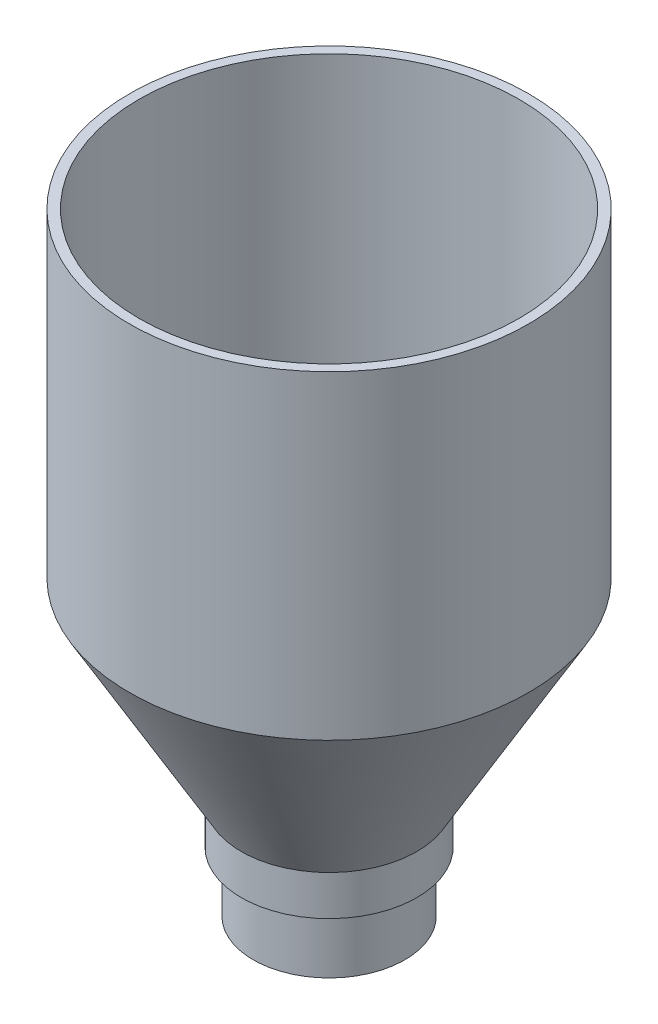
ISO-10303-21;
HEADER;
FILE_DESCRIPTION(('STEP AP214'),'2;1');
FILE_NAME('part.step','',(''),(''),'','','');
FILE_SCHEMA(('AUTOMOTIVE_DESIGN { 1 0 10303 214 1 1 1 1 }'));
ENDSEC;
DATA;
#1=APPLICATION_CONTEXT('core data for automotive mechanical design processes');
#2=APPLICATION_PROTOCOL_DEFINITION('international standard','automotive_design',2000,#1);
#3=PRODUCT_CONTEXT('',#1,'mechanical');
#4=PRODUCT('Part','Part','',(#3));
#5=PRODUCT_RELATED_PRODUCT_CATEGORY('part','',(#4));
#6=PRODUCT_DEFINITION_FORMATION('','',#4);
#7=PRODUCT_DEFINITION_CONTEXT('part definition',#1,'design');
#8=PRODUCT_DEFINITION('design','',#6,#7);
#9=PRODUCT_DEFINITION_SHAPE('','',#8);
#10=(LENGTH_UNIT() NAMED_UNIT(*) SI_UNIT(.MILLI.,.METRE.));
#11=(NAMED_UNIT(*) PLANE_ANGLE_UNIT() SI_UNIT($,.RADIAN.));
#12=(NAMED_UNIT(*) SI_UNIT($,.STERADIAN.) SOLID_ANGLE_UNIT());
#13=UNCERTAINTY_MEASURE_WITH_UNIT(LENGTH_MEASURE(1.E-05),#10,'distance_accuracy_value','');
#14=(GEOMETRIC_REPRESENTATION_CONTEXT(3) GLOBAL_UNCERTAINTY_ASSIGNED_CONTEXT((#13)) GLOBAL_UNIT_ASSIGNED_CONTEXT((#10,
#11,#12)) REPRESENTATION_CONTEXT('',''));
#15=CARTESIAN_POINT('',(0.,0.,0.));
#16=DIRECTION('',(0.,0.,1.));
#17=DIRECTION('',(1.,0.,0.));
#18=AXIS2_PLACEMENT_3D('',#15,#16,#17);
#19=CARTESIAN_POINT('',(0.,-4.53601171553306,0.));
#20=DIRECTION('',(0.,-1.,0.));
#21=DIRECTION('',(0.,0.,-1.));
#22=AXIS2_PLACEMENT_3D('',#19,#20,#21);
#23=CYLINDRICAL_SURFACE('',#22,25.);
#24=CARTESIAN_POINT('',(0.,36.7487113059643,0.));
#25=DIRECTION('',(0.,-1.,0.));
#26=DIRECTION('',(0.,0.,-1.));
#27=AXIS2_PLACEMENT_3D('',#24,#25,#26);
#28=CIRCLE('',#27,25.);
#29=CARTESIAN_POINT('',(0.,36.7487113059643,-25.));
#30=VERTEX_POINT('',#29);
#31=EDGE_CURVE('E70',#30,#30,#28,.T.);
#32=ORIENTED_EDGE('',*,*,#31,.F.);
#33=EDGE_LOOP('',(#32));
#34=FACE_BOUND('',#33,.T.);
#35=CARTESIAN_POINT('',(0.,76.7487113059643,0.));
#36=DIRECTION('',(0.,-1.,0.));
#37=DIRECTION('',(0.,0.,-1.));
#38=AXIS2_PLACEMENT_3D('',#35,#36,#37);
#39=CIRCLE('',#38,25.);
#40=CARTESIAN_POINT('',(0.,76.7487113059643,-25.));
#41=VERTEX_POINT('',#40);
#42=EDGE_CURVE('E10',#41,#41,#39,.T.);
#43=ORIENTED_EDGE('',*,*,#42,.T.);
#44=EDGE_LOOP('',(#43));
#45=FACE_BOUND('',#44,.T.);
#46=ADVANCED_FACE('F33',(#34,#45),#23,.T.);
#47=CARTESIAN_POINT('',(-25.,76.7487113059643,0.));
#48=DIRECTION('',(0.,-1.,0.));
#49=DIRECTION('',(0.,0.,-1.));
#50=AXIS2_PLACEMENT_3D('',#47,#48,#49);
#51=PLANE('',#50);
#52=ORIENTED_EDGE('',*,*,#42,.F.);
#53=EDGE_LOOP('',(#52));
#54=FACE_BOUND('',#53,.T.);
#55=CARTESIAN_POINT('',(0.,76.7487113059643,0.));
#56=DIRECTION('',(0.,-1.,0.));
#57=DIRECTION('',(0.,0.,-1.));
#58=AXIS2_PLACEMENT_3D('',#55,#56,#57);
#59=CIRCLE('',#58,23.8);
#60=CARTESIAN_POINT('',(0.,76.7487113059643,-23.8));
#61=VERTEX_POINT('',#60);
#62=EDGE_CURVE('E39',#61,#61,#59,.T.);
#63=ORIENTED_EDGE('',*,*,#62,.T.);
#64=EDGE_LOOP('',(#63));
#65=FACE_BOUND('',#64,.T.);
#66=ADVANCED_FACE('F77',(#54,#65),#51,.F.);
#67=CARTESIAN_POINT('',(0.,-4.53601171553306,0.));
#68=DIRECTION('',(0.,-1.,0.));
#69=DIRECTION('',(0.,0.,-1.));
#70=AXIS2_PLACEMENT_3D('',#67,#68,#69);
#71=CYLINDRICAL_SURFACE('',#70,23.8);
#72=ORIENTED_EDGE('',*,*,#62,.F.);
#73=EDGE_LOOP('',(#72));
#74=FACE_BOUND('',#73,.T.);
#75=CARTESIAN_POINT('',(0.,37.0702503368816,0.));
#76=DIRECTION('',(0.,-1.,0.));
#77=DIRECTION('',(0.,0.,-1.));
#78=AXIS2_PLACEMENT_3D('',#75,#76,#77);
#79=CIRCLE('',#78,23.8);
#80=CARTESIAN_POINT('',(0.,37.0702503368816,-23.8));
#81=VERTEX_POINT('',#80);
#82=EDGE_CURVE('E43',#81,#81,#79,.T.);
#83=ORIENTED_EDGE('',*,*,#82,.T.);
#84=EDGE_LOOP('',(#83));
#85=FACE_BOUND('',#84,.T.);
#86=ADVANCED_FACE('F81',(#74,#85),#71,.F.);
#87=CARTESIAN_POINT('',(0.,11.6124355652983,0.));
#88=DIRECTION('',(0.,1.,0.));
#89=DIRECTION('',(0.,0.,1.));
#90=AXIS2_PLACEMENT_3D('',#87,#88,#89);
#91=CONICAL_SURFACE('',#90,9.10192378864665,0.523598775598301);
#92=ORIENTED_EDGE('',*,*,#82,.F.);
#93=EDGE_LOOP('',(#92));
#94=FACE_BOUND('',#93,.T.);
#95=CARTESIAN_POINT('',(0.,11.6124355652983,0.));
#96=DIRECTION('',(0.,-1.,0.));
#97=DIRECTION('',(0.,0.,-1.));
#98=AXIS2_PLACEMENT_3D('',#95,#96,#97);
#99=CIRCLE('',#98,9.10192378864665);
#100=CARTESIAN_POINT('',(0.,11.6124355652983,-9.10192378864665));
#101=VERTEX_POINT('',#100);
#102=EDGE_CURVE('E47',#101,#101,#99,.T.);
#103=ORIENTED_EDGE('',*,*,#102,.T.);
#104=EDGE_LOOP('',(#103));
#105=FACE_BOUND('',#104,.T.);
#106=ADVANCED_FACE('F86',(#94,#105),#91,.F.);
#107=CARTESIAN_POINT('',(0.,7.50000000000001,0.));
#108=DIRECTION('',(0.,-1.,0.));
#109=DIRECTION('',(0.,0.,-1.));
#110=AXIS2_PLACEMENT_3D('',#107,#108,#109);
#111=TOROIDAL_SURFACE('',#110,16.2248711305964,8.22487113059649);
#112=ORIENTED_EDGE('',*,*,#102,.F.);
#113=EDGE_LOOP('',(#112));
#114=FACE_BOUND('',#113,.T.);
#115=CARTESIAN_POINT('',(0.,7.50000000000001,0.));
#116=DIRECTION('',(0.,-1.,0.));
#117=DIRECTION('',(0.,0.,-1.));
#118=AXIS2_PLACEMENT_3D('',#115,#116,#117);
#119=CIRCLE('',#118,7.99999999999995);
#120=CARTESIAN_POINT('',(0.,7.50000000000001,-7.99999999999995));
#121=VERTEX_POINT('',#120);
#122=EDGE_CURVE('E52',#121,#121,#119,.T.);
#123=ORIENTED_EDGE('',*,*,#122,.T.);
#124=EDGE_LOOP('',(#123));
#125=FACE_BOUND('',#124,.T.);
#126=ADVANCED_FACE('F92',(#114,#125),#111,.T.);
#127=CARTESIAN_POINT('',(0.,-4.53601171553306,0.));
#128=DIRECTION('',(0.,-1.,0.));
#129=DIRECTION('',(0.,0.,-1.));
#130=AXIS2_PLACEMENT_3D('',#127,#128,#129);
#131=CYLINDRICAL_SURFACE('',#130,7.99999999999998);
#132=ORIENTED_EDGE('',*,*,#122,.F.);
#133=EDGE_LOOP('',(#132));
#134=FACE_BOUND('',#133,.T.);
#135=CARTESIAN_POINT('',(0.,0.,0.));
#136=DIRECTION('',(0.,-1.,0.));
#137=DIRECTION('',(0.,0.,-1.));
#138=AXIS2_PLACEMENT_3D('',#135,#136,#137);
#139=CIRCLE('',#138,8.);
#140=CARTESIAN_POINT('',(0.,0.,-8.));
#141=VERTEX_POINT('',#140);
#142=EDGE_CURVE('E55',#141,#141,#139,.T.);
#143=ORIENTED_EDGE('',*,*,#142,.T.);
#144=EDGE_LOOP('',(#143));
#145=FACE_BOUND('',#144,.T.);
#146=ADVANCED_FACE('F96',(#134,#145),#131,.F.);
#147=CARTESIAN_POINT('',(-8.,0.,0.));
#148=DIRECTION('',(0.,1.,0.));
#149=DIRECTION('',(0.,0.,1.));
#150=AXIS2_PLACEMENT_3D('',#147,#148,#149);
#151=PLANE('',#150);
#152=ORIENTED_EDGE('',*,*,#142,.F.);
#153=EDGE_LOOP('',(#152));
#154=FACE_BOUND('',#153,.T.);
#155=CARTESIAN_POINT('',(0.,0.,0.));
#156=DIRECTION('',(0.,-1.,0.));
#157=DIRECTION('',(0.,0.,-1.));
#158=AXIS2_PLACEMENT_3D('',#155,#156,#157);
#159=CIRCLE('',#158,9.49999999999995);
#160=CARTESIAN_POINT('',(0.,0.,-9.49999999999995));
#161=VERTEX_POINT('',#160);
#162=EDGE_CURVE('E58',#161,#161,#159,.T.);
#163=ORIENTED_EDGE('',*,*,#162,.T.);
#164=EDGE_LOOP('',(#163));
#165=FACE_BOUND('',#164,.T.);
#166=ADVANCED_FACE('F100',(#154,#165),#151,.F.);
#167=CARTESIAN_POINT('',(0.,-4.53601171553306,0.));
#168=DIRECTION('',(0.,-1.,0.));
#169=DIRECTION('',(0.,0.,-1.));
#170=AXIS2_PLACEMENT_3D('',#167,#168,#169);
#171=CYLINDRICAL_SURFACE('',#170,9.49999999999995);
#172=ORIENTED_EDGE('',*,*,#162,.F.);
#173=EDGE_LOOP('',(#172));
#174=FACE_BOUND('',#173,.T.);
#175=CARTESIAN_POINT('',(0.,7.5,0.));
#176=DIRECTION('',(0.,-1.,0.));
#177=DIRECTION('',(0.,0.,-1.));
#178=AXIS2_PLACEMENT_3D('',#175,#176,#177);
#179=CIRCLE('',#178,9.49999999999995);
#180=CARTESIAN_POINT('',(0.,7.5,-9.49999999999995));
#181=VERTEX_POINT('',#180);
#182=EDGE_CURVE('E61',#181,#181,#179,.T.);
#183=ORIENTED_EDGE('',*,*,#182,.T.);
#184=EDGE_LOOP('',(#183));
#185=FACE_BOUND('',#184,.T.);
#186=ADVANCED_FACE('F104',(#174,#185),#171,.T.);
#187=CARTESIAN_POINT('',(-11.,7.5,0.));
#188=DIRECTION('',(0.,1.,0.));
#189=DIRECTION('',(0.,0.,1.));
#190=AXIS2_PLACEMENT_3D('',#187,#188,#189);
#191=PLANE('',#190);
#192=ORIENTED_EDGE('',*,*,#182,.F.);
#193=EDGE_LOOP('',(#192));
#194=FACE_BOUND('',#193,.T.);
#195=CARTESIAN_POINT('',(0.,7.5,0.));
#196=DIRECTION('',(0.,-1.,0.));
#197=DIRECTION('',(0.,0.,-1.));
#198=AXIS2_PLACEMENT_3D('',#195,#196,#197);
#199=CIRCLE('',#198,11.);
#200=CARTESIAN_POINT('',(0.,7.5,-11.));
#201=VERTEX_POINT('',#200);
#202=EDGE_CURVE('E64',#201,#201,#199,.T.);
#203=ORIENTED_EDGE('',*,*,#202,.T.);
#204=EDGE_LOOP('',(#203));
#205=FACE_BOUND('',#204,.T.);
#206=ADVANCED_FACE('F108',(#194,#205),#191,.F.);
#207=CARTESIAN_POINT('',(0.,-4.53601171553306,0.));
#208=DIRECTION('',(0.,-1.,0.));
#209=DIRECTION('',(0.,0.,-1.));
#210=AXIS2_PLACEMENT_3D('',#207,#208,#209);
#211=CYLINDRICAL_SURFACE('',#210,11.);
#212=ORIENTED_EDGE('',*,*,#202,.F.);
#213=EDGE_LOOP('',(#212));
#214=FACE_BOUND('',#213,.T.);
#215=CARTESIAN_POINT('',(0.,12.5,0.));
#216=DIRECTION('',(0.,-1.,0.));
#217=DIRECTION('',(0.,0.,-1.));
#218=AXIS2_PLACEMENT_3D('',#215,#216,#217);
#219=CIRCLE('',#218,11.);
#220=CARTESIAN_POINT('',(0.,12.5,-11.));
#221=VERTEX_POINT('',#220);
#222=EDGE_CURVE('E67',#221,#221,#219,.T.);
#223=ORIENTED_EDGE('',*,*,#222,.T.);
#224=EDGE_LOOP('',(#223));
#225=FACE_BOUND('',#224,.T.);
#226=ADVANCED_FACE('F112',(#214,#225),#211,.T.);
#227=CARTESIAN_POINT('',(0.,36.7487113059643,0.));
#228=DIRECTION('',(0.,1.,0.));
#229=DIRECTION('',(0.,0.,1.));
#230=AXIS2_PLACEMENT_3D('',#227,#228,#229);
#231=CONICAL_SURFACE('',#230,25.,0.5235987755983);
#232=ORIENTED_EDGE('',*,*,#222,.F.);
#233=EDGE_LOOP('',(#232));
#234=FACE_BOUND('',#233,.T.);
#235=ORIENTED_EDGE('',*,*,#31,.T.);
#236=EDGE_LOOP('',(#235));
#237=FACE_BOUND('',#236,.T.);
#238=ADVANCED_FACE('F74',(#234,#237),#231,.T.);
#239=CLOSED_SHELL('',(#46,#66,#86,#106,#126,#146,#166,#186,#206,#226,#238));
#240=MANIFOLD_SOLID_BREP('B2',#239);
#241=ADVANCED_BREP_SHAPE_REPRESENTATION('',(#18,#240),#14);
#242=SHAPE_DEFINITION_REPRESENTATION(#9,#241);
ENDSEC;
END-ISO-10303-21;
